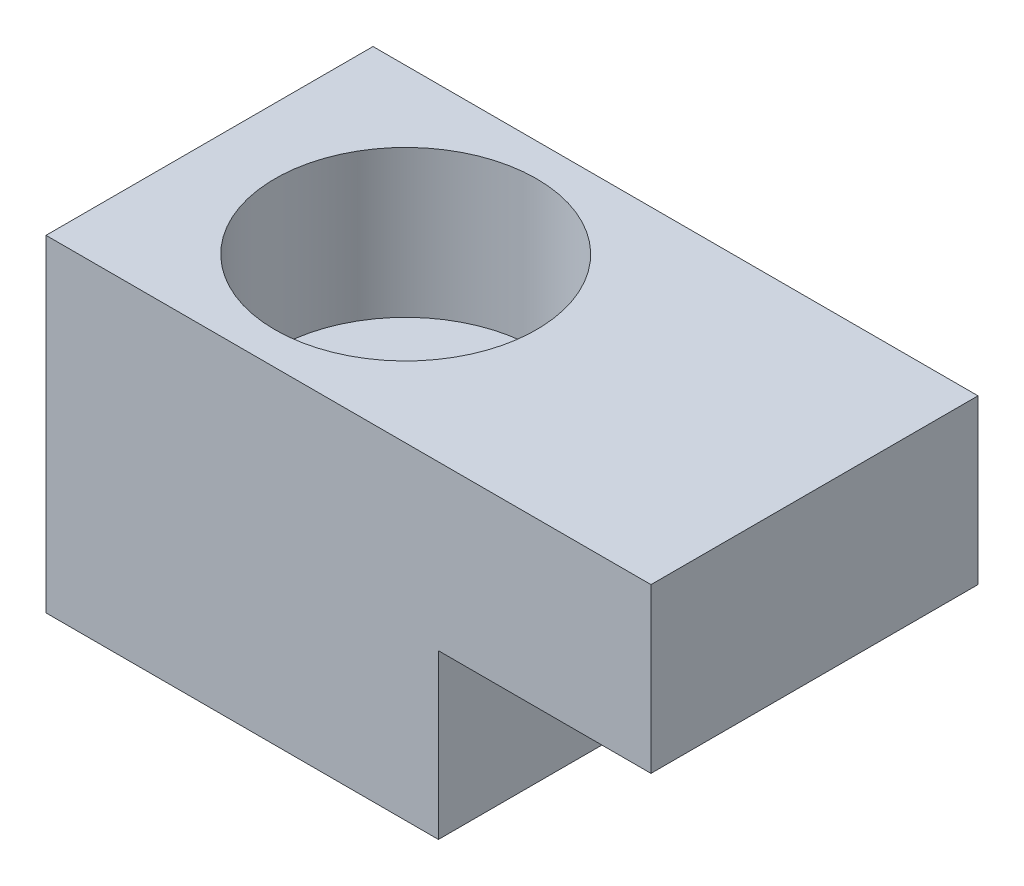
ISO-10303-21;
HEADER;
FILE_DESCRIPTION(('STEP AP214'),'2;1');
FILE_NAME('part.step','',(''),(''),'','','');
FILE_SCHEMA(('AUTOMOTIVE_DESIGN { 1 0 10303 214 1 1 1 1 }'));
ENDSEC;
DATA;
#1=APPLICATION_CONTEXT('core data for automotive mechanical design processes');
#2=APPLICATION_PROTOCOL_DEFINITION('international standard','automotive_design',2000,#1);
#3=PRODUCT_CONTEXT('',#1,'mechanical');
#4=PRODUCT('Part','Part','',(#3));
#5=PRODUCT_RELATED_PRODUCT_CATEGORY('part','',(#4));
#6=PRODUCT_DEFINITION_FORMATION('','',#4);
#7=PRODUCT_DEFINITION_CONTEXT('part definition',#1,'design');
#8=PRODUCT_DEFINITION('design','',#6,#7);
#9=PRODUCT_DEFINITION_SHAPE('','',#8);
#10=(LENGTH_UNIT() NAMED_UNIT(*) SI_UNIT(.MILLI.,.METRE.));
#11=(NAMED_UNIT(*) PLANE_ANGLE_UNIT() SI_UNIT($,.RADIAN.));
#12=(NAMED_UNIT(*) SI_UNIT($,.STERADIAN.) SOLID_ANGLE_UNIT());
#13=UNCERTAINTY_MEASURE_WITH_UNIT(LENGTH_MEASURE(1.E-05),#10,'distance_accuracy_value','');
#14=(GEOMETRIC_REPRESENTATION_CONTEXT(3) GLOBAL_UNCERTAINTY_ASSIGNED_CONTEXT((#13)) GLOBAL_UNIT_ASSIGNED_CONTEXT((#10,
#11,#12)) REPRESENTATION_CONTEXT('',''));
#15=CARTESIAN_POINT('',(0.,0.,0.));
#16=DIRECTION('',(0.,0.,1.));
#17=DIRECTION('',(1.,0.,0.));
#18=AXIS2_PLACEMENT_3D('',#15,#16,#17);
#19=CARTESIAN_POINT('',(6.,-1.14491749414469E-13,5.));
#20=DIRECTION('',(0.,1.,0.));
#21=DIRECTION('',(0.,0.,1.));
#22=AXIS2_PLACEMENT_3D('',#19,#20,#21);
#23=CYLINDRICAL_SURFACE('',#22,2.25);
#24=CARTESIAN_POINT('',(6.,-1.14491749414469E-13,5.));
#25=DIRECTION('',(0.,1.,0.));
#26=DIRECTION('',(0.,0.,1.));
#27=AXIS2_PLACEMENT_3D('',#24,#25,#26);
#28=CIRCLE('',#27,2.25);
#29=CARTESIAN_POINT('',(6.,-1.14491749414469E-13,7.25));
#30=VERTEX_POINT('',#29);
#31=EDGE_CURVE('E122',#30,#30,#28,.T.);
#32=ORIENTED_EDGE('',*,*,#31,.F.);
#33=EDGE_LOOP('',(#32));
#34=FACE_BOUND('',#33,.T.);
#35=CARTESIAN_POINT('',(6.,5.49999999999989,5.));
#36=DIRECTION('',(0.,1.,0.));
#37=DIRECTION('',(0.,0.,1.));
#38=AXIS2_PLACEMENT_3D('',#35,#36,#37);
#39=CIRCLE('',#38,2.25);
#40=CARTESIAN_POINT('',(6.,5.49999999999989,7.25));
#41=VERTEX_POINT('',#40);
#42=EDGE_CURVE('E36',#41,#41,#39,.F.);
#43=ORIENTED_EDGE('',*,*,#42,.F.);
#44=EDGE_LOOP('',(#43));
#45=FACE_BOUND('',#44,.T.);
#46=ADVANCED_FACE('F32',(#34,#45),#23,.F.);
#47=CARTESIAN_POINT('',(0.,-1.13686837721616E-13,10.));
#48=DIRECTION('',(0.,1.,0.));
#49=DIRECTION('',(-1.,0.,0.));
#50=AXIS2_PLACEMENT_3D('',#47,#48,#49);
#51=PLANE('',#50);
#52=ORIENTED_EDGE('',*,*,#31,.T.);
#53=EDGE_LOOP('',(#52));
#54=FACE_BOUND('',#53,.T.);
#55=DIRECTION('',(1.,0.,0.));
#56=VECTOR('',#55,1.);
#57=CARTESIAN_POINT('',(0.,-1.13686837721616E-13,0.));
#58=LINE('',#57,#56);
#59=CARTESIAN_POINT('',(0.,-1.13686837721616E-13,0.));
#60=VERTEX_POINT('',#59);
#61=CARTESIAN_POINT('',(12.,0.,0.));
#62=VERTEX_POINT('',#61);
#63=EDGE_CURVE('E118',#60,#62,#58,.T.);
#64=ORIENTED_EDGE('',*,*,#63,.T.);
#65=DIRECTION('',(0.,0.,-1.));
#66=VECTOR('',#65,1.);
#67=CARTESIAN_POINT('',(12.,0.,10.));
#68=LINE('',#67,#66);
#69=CARTESIAN_POINT('',(12.,0.,10.));
#70=VERTEX_POINT('',#69);
#71=EDGE_CURVE('E11',#70,#62,#68,.T.);
#72=ORIENTED_EDGE('',*,*,#71,.F.);
#73=DIRECTION('',(1.,0.,0.));
#74=VECTOR('',#73,1.);
#75=CARTESIAN_POINT('',(0.,-1.13686837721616E-13,10.));
#76=LINE('',#75,#74);
#77=CARTESIAN_POINT('',(0.,-1.13686837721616E-13,10.));
#78=VERTEX_POINT('',#77);
#79=EDGE_CURVE('E129',#78,#70,#76,.T.);
#80=ORIENTED_EDGE('',*,*,#79,.F.);
#81=DIRECTION('',(0.,0.,-1.));
#82=VECTOR('',#81,1.);
#83=CARTESIAN_POINT('',(0.,-1.13686837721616E-13,10.));
#84=LINE('',#83,#82);
#85=EDGE_CURVE('E114',#78,#60,#84,.T.);
#86=ORIENTED_EDGE('',*,*,#85,.T.);
#87=EDGE_LOOP('',(#64,#72,#80,#86));
#88=FACE_BOUND('',#87,.T.);
#89=ADVANCED_FACE('F34',(#54,#88),#51,.F.);
#90=CARTESIAN_POINT('',(12.,0.,10.));
#91=DIRECTION('',(-1.,0.,0.));
#92=DIRECTION('',(0.,0.,1.));
#93=AXIS2_PLACEMENT_3D('',#90,#91,#92);
#94=PLANE('',#93);
#95=DIRECTION('',(0.,1.,0.));
#96=VECTOR('',#95,1.);
#97=CARTESIAN_POINT('',(12.,0.,0.));
#98=LINE('',#97,#96);
#99=CARTESIAN_POINT('',(12.,4.99999999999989,0.));
#100=VERTEX_POINT('',#99);
#101=EDGE_CURVE('E121',#62,#100,#98,.T.);
#102=ORIENTED_EDGE('',*,*,#101,.T.);
#103=DIRECTION('',(0.,0.,-1.));
#104=VECTOR('',#103,1.);
#105=CARTESIAN_POINT('',(12.,4.99999999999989,10.));
#106=LINE('',#105,#104);
#107=CARTESIAN_POINT('',(12.,4.99999999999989,10.));
#108=VERTEX_POINT('',#107);
#109=EDGE_CURVE('E42',#108,#100,#106,.T.);
#110=ORIENTED_EDGE('',*,*,#109,.F.);
#111=DIRECTION('',(0.,1.,0.));
#112=VECTOR('',#111,1.);
#113=CARTESIAN_POINT('',(12.,0.,10.));
#114=LINE('',#113,#112);
#115=EDGE_CURVE('E87',#70,#108,#114,.T.);
#116=ORIENTED_EDGE('',*,*,#115,.F.);
#117=ORIENTED_EDGE('',*,*,#71,.T.);
#118=EDGE_LOOP('',(#102,#110,#116,#117));
#119=FACE_BOUND('',#118,.T.);
#120=ADVANCED_FACE('F160',(#119),#94,.F.);
#121=CARTESIAN_POINT('',(12.,4.99999999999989,10.));
#122=DIRECTION('',(0.,1.,0.));
#123=DIRECTION('',(0.,0.,1.));
#124=AXIS2_PLACEMENT_3D('',#121,#122,#123);
#125=PLANE('',#124);
#126=CARTESIAN_POINT('',(15.2500000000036,4.99999999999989,5.));
#127=DIRECTION('',(0.,-1.,0.));
#128=DIRECTION('',(0.,0.,-1.));
#129=AXIS2_PLACEMENT_3D('',#126,#127,#128);
#130=CIRCLE('',#129,2.1);
#131=CARTESIAN_POINT('',(15.2500000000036,4.99999999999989,2.9));
#132=VERTEX_POINT('',#131);
#133=EDGE_CURVE('E193',#132,#132,#130,.T.);
#134=ORIENTED_EDGE('',*,*,#133,.F.);
#135=EDGE_LOOP('',(#134));
#136=FACE_BOUND('',#135,.T.);
#137=DIRECTION('',(1.,0.,0.));
#138=VECTOR('',#137,1.);
#139=CARTESIAN_POINT('',(12.,4.99999999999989,0.));
#140=LINE('',#139,#138);
#141=CARTESIAN_POINT('',(18.5,4.99999999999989,0.));
#142=VERTEX_POINT('',#141);
#143=EDGE_CURVE('E124',#100,#142,#140,.T.);
#144=ORIENTED_EDGE('',*,*,#143,.T.);
#145=DIRECTION('',(0.,0.,-1.));
#146=VECTOR('',#145,1.);
#147=CARTESIAN_POINT('',(18.5,4.99999999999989,10.));
#148=LINE('',#147,#146);
#149=CARTESIAN_POINT('',(18.5,4.99999999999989,10.));
#150=VERTEX_POINT('',#149);
#151=EDGE_CURVE('E109',#150,#142,#148,.T.);
#152=ORIENTED_EDGE('',*,*,#151,.F.);
#153=DIRECTION('',(1.,0.,0.));
#154=VECTOR('',#153,1.);
#155=CARTESIAN_POINT('',(12.,4.99999999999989,10.));
#156=LINE('',#155,#154);
#157=EDGE_CURVE('E100',#108,#150,#156,.T.);
#158=ORIENTED_EDGE('',*,*,#157,.F.);
#159=ORIENTED_EDGE('',*,*,#109,.T.);
#160=EDGE_LOOP('',(#144,#152,#158,#159));
#161=FACE_BOUND('',#160,.T.);
#162=ADVANCED_FACE('F136',(#136,#161),#125,.F.);
#163=CARTESIAN_POINT('',(18.5,4.99999999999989,10.));
#164=DIRECTION('',(-1.,0.,0.));
#165=DIRECTION('',(0.,0.,1.));
#166=AXIS2_PLACEMENT_3D('',#163,#164,#165);
#167=PLANE('',#166);
#168=DIRECTION('',(0.,1.,0.));
#169=VECTOR('',#168,1.);
#170=CARTESIAN_POINT('',(18.5,4.99999999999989,0.));
#171=LINE('',#170,#169);
#172=CARTESIAN_POINT('',(18.5,9.99999999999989,0.));
#173=VERTEX_POINT('',#172);
#174=EDGE_CURVE('E108',#142,#173,#171,.T.);
#175=ORIENTED_EDGE('',*,*,#174,.T.);
#176=DIRECTION('',(0.,0.,-1.));
#177=VECTOR('',#176,1.);
#178=CARTESIAN_POINT('',(18.5,9.99999999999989,10.));
#179=LINE('',#178,#177);
#180=CARTESIAN_POINT('',(18.5,9.99999999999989,10.));
#181=VERTEX_POINT('',#180);
#182=EDGE_CURVE('E105',#181,#173,#179,.T.);
#183=ORIENTED_EDGE('',*,*,#182,.F.);
#184=DIRECTION('',(0.,1.,0.));
#185=VECTOR('',#184,1.);
#186=CARTESIAN_POINT('',(18.5,4.99999999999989,10.));
#187=LINE('',#186,#185);
#188=EDGE_CURVE('E94',#150,#181,#187,.T.);
#189=ORIENTED_EDGE('',*,*,#188,.F.);
#190=ORIENTED_EDGE('',*,*,#151,.T.);
#191=EDGE_LOOP('',(#175,#183,#189,#190));
#192=FACE_BOUND('',#191,.T.);
#193=ADVANCED_FACE('F106',(#192),#167,.F.);
#194=CARTESIAN_POINT('',(0.,9.99999999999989,10.));
#195=DIRECTION('',(0.,-1.,0.));
#196=DIRECTION('',(0.,0.,-1.));
#197=AXIS2_PLACEMENT_3D('',#194,#195,#196);
#198=PLANE('',#197);
#199=CARTESIAN_POINT('',(6.,9.99999999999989,5.));
#200=DIRECTION('',(0.,1.,0.));
#201=DIRECTION('',(0.,0.,1.));
#202=AXIS2_PLACEMENT_3D('',#199,#200,#201);
#203=CIRCLE('',#202,4.);
#204=CARTESIAN_POINT('',(6.,9.99999999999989,9.));
#205=VERTEX_POINT('',#204);
#206=EDGE_CURVE('E192',#205,#205,#203,.T.);
#207=ORIENTED_EDGE('',*,*,#206,.F.);
#208=EDGE_LOOP('',(#207));
#209=FACE_BOUND('',#208,.T.);
#210=DIRECTION('',(-1.,0.,0.));
#211=VECTOR('',#210,1.);
#212=CARTESIAN_POINT('',(0.,9.99999999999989,0.));
#213=LINE('',#212,#211);
#214=CARTESIAN_POINT('',(0.,9.99999999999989,0.));
#215=VERTEX_POINT('',#214);
#216=EDGE_CURVE('E73',#173,#215,#213,.T.);
#217=ORIENTED_EDGE('',*,*,#216,.T.);
#218=DIRECTION('',(0.,0.,-1.));
#219=VECTOR('',#218,1.);
#220=CARTESIAN_POINT('',(0.,9.99999999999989,10.));
#221=LINE('',#220,#219);
#222=CARTESIAN_POINT('',(0.,9.99999999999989,10.));
#223=VERTEX_POINT('',#222);
#224=EDGE_CURVE('E110',#223,#215,#221,.T.);
#225=ORIENTED_EDGE('',*,*,#224,.F.);
#226=DIRECTION('',(-1.,0.,0.));
#227=VECTOR('',#226,1.);
#228=CARTESIAN_POINT('',(0.,9.99999999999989,10.));
#229=LINE('',#228,#227);
#230=EDGE_CURVE('E98',#181,#223,#229,.T.);
#231=ORIENTED_EDGE('',*,*,#230,.F.);
#232=ORIENTED_EDGE('',*,*,#182,.T.);
#233=EDGE_LOOP('',(#217,#225,#231,#232));
#234=FACE_BOUND('',#233,.T.);
#235=ADVANCED_FACE('F112',(#209,#234),#198,.F.);
#236=CARTESIAN_POINT('',(0.,-1.13686837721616E-13,10.));
#237=DIRECTION('',(1.,0.,0.));
#238=DIRECTION('',(0.,0.,-1.));
#239=AXIS2_PLACEMENT_3D('',#236,#237,#238);
#240=PLANE('',#239);
#241=DIRECTION('',(0.,-1.,0.));
#242=VECTOR('',#241,1.);
#243=CARTESIAN_POINT('',(0.,-1.13686837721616E-13,0.));
#244=LINE('',#243,#242);
#245=EDGE_CURVE('E79',#215,#60,#244,.T.);
#246=ORIENTED_EDGE('',*,*,#245,.T.);
#247=ORIENTED_EDGE('',*,*,#85,.F.);
#248=DIRECTION('',(0.,-1.,0.));
#249=VECTOR('',#248,1.);
#250=CARTESIAN_POINT('',(0.,-1.13686837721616E-13,10.));
#251=LINE('',#250,#249);
#252=EDGE_CURVE('E50',#223,#78,#251,.T.);
#253=ORIENTED_EDGE('',*,*,#252,.F.);
#254=ORIENTED_EDGE('',*,*,#224,.T.);
#255=EDGE_LOOP('',(#246,#247,#253,#254));
#256=FACE_BOUND('',#255,.T.);
#257=ADVANCED_FACE('F143',(#256),#240,.F.);
#258=CARTESIAN_POINT('',(12.,0.,10.));
#259=DIRECTION('',(0.,0.,1.));
#260=DIRECTION('',(1.,0.,0.));
#261=AXIS2_PLACEMENT_3D('',#258,#259,#260);
#262=PLANE('',#261);
#263=ORIENTED_EDGE('',*,*,#79,.T.);
#264=ORIENTED_EDGE('',*,*,#115,.T.);
#265=ORIENTED_EDGE('',*,*,#157,.T.);
#266=ORIENTED_EDGE('',*,*,#188,.T.);
#267=ORIENTED_EDGE('',*,*,#230,.T.);
#268=ORIENTED_EDGE('',*,*,#252,.T.);
#269=EDGE_LOOP('',(#263,#264,#265,#266,#267,#268));
#270=FACE_BOUND('',#269,.T.);
#271=ADVANCED_FACE('F96',(#270),#262,.T.);
#272=CARTESIAN_POINT('',(12.,0.,0.));
#273=DIRECTION('',(0.,0.,1.));
#274=DIRECTION('',(1.,0.,0.));
#275=AXIS2_PLACEMENT_3D('',#272,#273,#274);
#276=PLANE('',#275);
#277=ORIENTED_EDGE('',*,*,#63,.F.);
#278=ORIENTED_EDGE('',*,*,#245,.F.);
#279=ORIENTED_EDGE('',*,*,#216,.F.);
#280=ORIENTED_EDGE('',*,*,#174,.F.);
#281=ORIENTED_EDGE('',*,*,#143,.F.);
#282=ORIENTED_EDGE('',*,*,#101,.F.);
#283=EDGE_LOOP('',(#277,#278,#279,#280,#281,#282));
#284=FACE_BOUND('',#283,.T.);
#285=ADVANCED_FACE('F139',(#284),#276,.F.);
#286=CARTESIAN_POINT('',(6.,5.49999999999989,5.));
#287=DIRECTION('',(0.,1.,0.));
#288=DIRECTION('',(0.,0.,1.));
#289=AXIS2_PLACEMENT_3D('',#286,#287,#288);
#290=PLANE('',#289);
#291=CARTESIAN_POINT('',(6.,5.49999999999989,5.));
#292=DIRECTION('',(0.,1.,0.));
#293=DIRECTION('',(0.,0.,1.));
#294=AXIS2_PLACEMENT_3D('',#291,#292,#293);
#295=CIRCLE('',#294,4.);
#296=CARTESIAN_POINT('',(6.,5.49999999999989,9.));
#297=VERTEX_POINT('',#296);
#298=EDGE_CURVE('E196',#297,#297,#295,.T.);
#299=ORIENTED_EDGE('',*,*,#298,.T.);
#300=EDGE_LOOP('',(#299));
#301=FACE_BOUND('',#300,.T.);
#302=ORIENTED_EDGE('',*,*,#42,.T.);
#303=EDGE_LOOP('',(#302));
#304=FACE_BOUND('',#303,.T.);
#305=ADVANCED_FACE('F168',(#301,#304),#290,.T.);
#306=CARTESIAN_POINT('',(6.,5.49999999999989,5.));
#307=DIRECTION('',(0.,1.,0.));
#308=DIRECTION('',(0.,0.,1.));
#309=AXIS2_PLACEMENT_3D('',#306,#307,#308);
#310=CYLINDRICAL_SURFACE('',#309,4.);
#311=ORIENTED_EDGE('',*,*,#298,.F.);
#312=EDGE_LOOP('',(#311));
#313=FACE_BOUND('',#312,.T.);
#314=ORIENTED_EDGE('',*,*,#206,.T.);
#315=EDGE_LOOP('',(#314));
#316=FACE_BOUND('',#315,.T.);
#317=ADVANCED_FACE('F165',(#313,#316),#310,.F.);
#318=CARTESIAN_POINT('',(15.2500000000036,7.99999999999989,5.));
#319=DIRECTION('',(0.,-1.,0.));
#320=DIRECTION('',(0.,0.,-1.));
#321=AXIS2_PLACEMENT_3D('',#318,#319,#320);
#322=CYLINDRICAL_SURFACE('',#321,2.1);
#323=CARTESIAN_POINT('',(15.2500000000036,7.99999999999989,5.));
#324=DIRECTION('',(0.,-1.,0.));
#325=DIRECTION('',(0.,0.,-1.));
#326=AXIS2_PLACEMENT_3D('',#323,#324,#325);
#327=CIRCLE('',#326,2.1);
#328=CARTESIAN_POINT('',(15.2500000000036,7.99999999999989,2.9));
#329=VERTEX_POINT('',#328);
#330=EDGE_CURVE('E191',#329,#329,#327,.T.);
#331=ORIENTED_EDGE('',*,*,#330,.F.);
#332=EDGE_LOOP('',(#331));
#333=FACE_BOUND('',#332,.T.);
#334=ORIENTED_EDGE('',*,*,#133,.T.);
#335=EDGE_LOOP('',(#334));
#336=FACE_BOUND('',#335,.T.);
#337=ADVANCED_FACE('F176',(#333,#336),#322,.F.);
#338=CARTESIAN_POINT('',(15.2500000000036,7.99999999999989,5.));
#339=DIRECTION('',(0.,-1.,0.));
#340=DIRECTION('',(0.,0.,-1.));
#341=AXIS2_PLACEMENT_3D('',#338,#339,#340);
#342=PLANE('',#341);
#343=ORIENTED_EDGE('',*,*,#330,.T.);
#344=EDGE_LOOP('',(#343));
#345=FACE_BOUND('',#344,.T.);
#346=ADVANCED_FACE('F183',(#345),#342,.T.);
#347=CLOSED_SHELL('',(#46,#89,#120,#162,#193,#235,#257,#271,#285,#305,#317,#337,#346));
#348=MANIFOLD_SOLID_BREP('B2',#347);
#349=ADVANCED_BREP_SHAPE_REPRESENTATION('',(#18,#348),#14);
#350=SHAPE_DEFINITION_REPRESENTATION(#9,#349);
ENDSEC;
END-ISO-10303-21;
